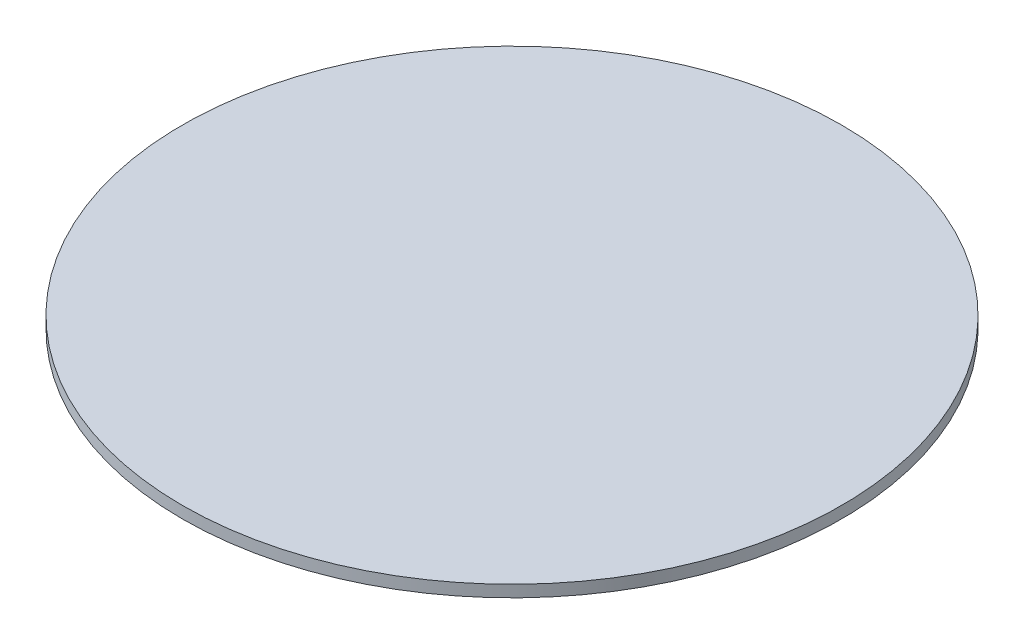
ISO-10303-21;
HEADER;
FILE_DESCRIPTION(('STEP AP214'),'2;1');
FILE_NAME('part.step','',(''),(''),'','','');
FILE_SCHEMA(('AUTOMOTIVE_DESIGN { 1 0 10303 214 1 1 1 1 }'));
ENDSEC;
DATA;
#1=APPLICATION_CONTEXT('core data for automotive mechanical design processes');
#2=APPLICATION_PROTOCOL_DEFINITION('international standard','automotive_design',2000,#1);
#3=PRODUCT_CONTEXT('',#1,'mechanical');
#4=PRODUCT('Part','Part','',(#3));
#5=PRODUCT_RELATED_PRODUCT_CATEGORY('part','',(#4));
#6=PRODUCT_DEFINITION_FORMATION('','',#4);
#7=PRODUCT_DEFINITION_CONTEXT('part definition',#1,'design');
#8=PRODUCT_DEFINITION('design','',#6,#7);
#9=PRODUCT_DEFINITION_SHAPE('','',#8);
#10=(LENGTH_UNIT() NAMED_UNIT(*) SI_UNIT(.MILLI.,.METRE.));
#11=(NAMED_UNIT(*) PLANE_ANGLE_UNIT() SI_UNIT($,.RADIAN.));
#12=(NAMED_UNIT(*) SI_UNIT($,.STERADIAN.) SOLID_ANGLE_UNIT());
#13=UNCERTAINTY_MEASURE_WITH_UNIT(LENGTH_MEASURE(1.E-05),#10,'distance_accuracy_value','');
#14=(GEOMETRIC_REPRESENTATION_CONTEXT(3) GLOBAL_UNCERTAINTY_ASSIGNED_CONTEXT((#13)) GLOBAL_UNIT_ASSIGNED_CONTEXT((#10,
#11,#12)) REPRESENTATION_CONTEXT('',''));
#15=CARTESIAN_POINT('',(0.,0.,0.));
#16=DIRECTION('',(0.,0.,1.));
#17=DIRECTION('',(1.,0.,0.));
#18=AXIS2_PLACEMENT_3D('',#15,#16,#17);
#19=CARTESIAN_POINT('',(0.,1.5875,0.));
#20=DIRECTION('',(0.,-1.,0.));
#21=DIRECTION('',(0.,0.,-1.));
#22=AXIS2_PLACEMENT_3D('',#19,#20,#21);
#23=CYLINDRICAL_SURFACE('',#22,44.45);
#24=CARTESIAN_POINT('',(0.,1.5875,0.));
#25=DIRECTION('',(0.,1.,0.));
#26=DIRECTION('',(0.,0.,1.));
#27=AXIS2_PLACEMENT_3D('',#24,#25,#26);
#28=CIRCLE('',#27,44.45);
#29=CARTESIAN_POINT('',(0.,1.5875,44.45));
#30=VERTEX_POINT('',#29);
#31=EDGE_CURVE('E10',#30,#30,#28,.T.);
#32=ORIENTED_EDGE('',*,*,#31,.F.);
#33=EDGE_LOOP('',(#32));
#34=FACE_BOUND('',#33,.T.);
#35=CARTESIAN_POINT('',(0.,0.,0.));
#36=DIRECTION('',(0.,1.,0.));
#37=DIRECTION('',(0.,0.,1.));
#38=AXIS2_PLACEMENT_3D('',#35,#36,#37);
#39=CIRCLE('',#38,44.45);
#40=CARTESIAN_POINT('',(0.,0.,44.45));
#41=VERTEX_POINT('',#40);
#42=EDGE_CURVE('E40',#41,#41,#39,.T.);
#43=ORIENTED_EDGE('',*,*,#42,.T.);
#44=EDGE_LOOP('',(#43));
#45=FACE_BOUND('',#44,.T.);
#46=ADVANCED_FACE('F37',(#34,#45),#23,.T.);
#47=CARTESIAN_POINT('',(0.,1.5875,0.));
#48=DIRECTION('',(0.,1.,0.));
#49=DIRECTION('',(0.,0.,1.));
#50=AXIS2_PLACEMENT_3D('',#47,#48,#49);
#51=PLANE('',#50);
#52=ORIENTED_EDGE('',*,*,#31,.T.);
#53=EDGE_LOOP('',(#52));
#54=FACE_BOUND('',#53,.T.);
#55=ADVANCED_FACE('F54',(#54),#51,.T.);
#56=CARTESIAN_POINT('',(0.,0.,0.));
#57=DIRECTION('',(0.,1.,0.));
#58=DIRECTION('',(0.,0.,1.));
#59=AXIS2_PLACEMENT_3D('',#56,#57,#58);
#60=PLANE('',#59);
#61=ORIENTED_EDGE('',*,*,#42,.F.);
#62=EDGE_LOOP('',(#61));
#63=FACE_BOUND('',#62,.T.);
#64=ADVANCED_FACE('F52',(#63),#60,.F.);
#65=CLOSED_SHELL('',(#46,#55,#64));
#66=MANIFOLD_SOLID_BREP('B2',#65);
#67=ADVANCED_BREP_SHAPE_REPRESENTATION('',(#18,#66),#14);
#68=SHAPE_DEFINITION_REPRESENTATION(#9,#67);
ENDSEC;
END-ISO-10303-21;
